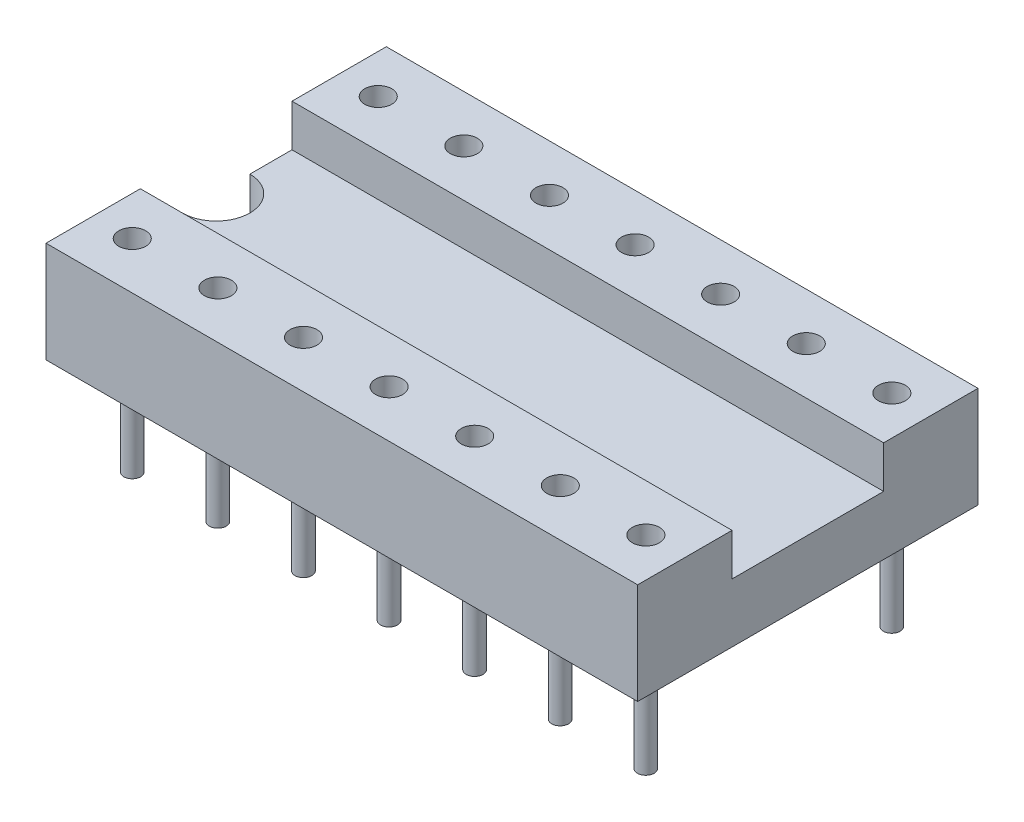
ISO-10303-21;
HEADER;
FILE_DESCRIPTION(('STEP AP214'),'2;1');
FILE_NAME('part.step','',(''),(''),'','','');
FILE_SCHEMA(('AUTOMOTIVE_DESIGN { 1 0 10303 214 1 1 1 1 }'));
ENDSEC;
DATA;
#1=APPLICATION_CONTEXT('core data for automotive mechanical design processes');
#2=APPLICATION_PROTOCOL_DEFINITION('international standard','automotive_design',2000,#1);
#3=PRODUCT_CONTEXT('',#1,'mechanical');
#4=PRODUCT('Part','Part','',(#3));
#5=PRODUCT_RELATED_PRODUCT_CATEGORY('part','',(#4));
#6=PRODUCT_DEFINITION_FORMATION('','',#4);
#7=PRODUCT_DEFINITION_CONTEXT('part definition',#1,'design');
#8=PRODUCT_DEFINITION('design','',#6,#7);
#9=PRODUCT_DEFINITION_SHAPE('','',#8);
#10=(LENGTH_UNIT() NAMED_UNIT(*) SI_UNIT(.MILLI.,.METRE.));
#11=(NAMED_UNIT(*) PLANE_ANGLE_UNIT() SI_UNIT($,.RADIAN.));
#12=(NAMED_UNIT(*) SI_UNIT($,.STERADIAN.) SOLID_ANGLE_UNIT());
#13=UNCERTAINTY_MEASURE_WITH_UNIT(LENGTH_MEASURE(1.E-05),#10,'distance_accuracy_value','');
#14=(GEOMETRIC_REPRESENTATION_CONTEXT(3) GLOBAL_UNCERTAINTY_ASSIGNED_CONTEXT((#13)) GLOBAL_UNIT_ASSIGNED_CONTEXT((#10,
#11,#12)) REPRESENTATION_CONTEXT('',''));
#15=CARTESIAN_POINT('',(0.,0.,0.));
#16=DIRECTION('',(0.,0.,1.));
#17=DIRECTION('',(1.,0.,0.));
#18=AXIS2_PLACEMENT_3D('',#15,#16,#17);
#19=CARTESIAN_POINT('',(17.56,0.,5.05));
#20=DIRECTION('',(0.,1.,0.));
#21=DIRECTION('',(0.,0.,1.));
#22=AXIS2_PLACEMENT_3D('',#19,#20,#21);
#23=PLANE('',#22);
#24=CARTESIAN_POINT('',(16.4,0.,3.65));
#25=DIRECTION('',(0.,1.,0.));
#26=DIRECTION('',(0.,0.,1.));
#27=AXIS2_PLACEMENT_3D('',#24,#25,#26);
#28=CIRCLE('',#27,0.25);
#29=CARTESIAN_POINT('',(16.4,0.,3.9));
#30=VERTEX_POINT('',#29);
#31=EDGE_CURVE('E42',#30,#30,#28,.F.);
#32=ORIENTED_EDGE('',*,*,#31,.F.);
#33=EDGE_LOOP('',(#32));
#34=FACE_BOUND('',#33,.T.);
#35=CARTESIAN_POINT('',(13.86,0.,3.65));
#36=DIRECTION('',(0.,1.,0.));
#37=DIRECTION('',(0.,0.,1.));
#38=AXIS2_PLACEMENT_3D('',#35,#36,#37);
#39=CIRCLE('',#38,0.25);
#40=CARTESIAN_POINT('',(13.86,0.,3.9));
#41=VERTEX_POINT('',#40);
#42=EDGE_CURVE('E218',#41,#41,#39,.F.);
#43=ORIENTED_EDGE('',*,*,#42,.F.);
#44=EDGE_LOOP('',(#43));
#45=FACE_BOUND('',#44,.T.);
#46=CARTESIAN_POINT('',(11.32,0.,3.65));
#47=DIRECTION('',(0.,1.,0.));
#48=DIRECTION('',(0.,0.,1.));
#49=AXIS2_PLACEMENT_3D('',#46,#47,#48);
#50=CIRCLE('',#49,0.25);
#51=CARTESIAN_POINT('',(11.32,0.,3.9));
#52=VERTEX_POINT('',#51);
#53=EDGE_CURVE('E212',#52,#52,#50,.F.);
#54=ORIENTED_EDGE('',*,*,#53,.F.);
#55=EDGE_LOOP('',(#54));
#56=FACE_BOUND('',#55,.T.);
#57=CARTESIAN_POINT('',(8.78,0.,3.65));
#58=DIRECTION('',(0.,1.,0.));
#59=DIRECTION('',(0.,0.,1.));
#60=AXIS2_PLACEMENT_3D('',#57,#58,#59);
#61=CIRCLE('',#60,0.25);
#62=CARTESIAN_POINT('',(8.78,0.,3.9));
#63=VERTEX_POINT('',#62);
#64=EDGE_CURVE('E206',#63,#63,#61,.F.);
#65=ORIENTED_EDGE('',*,*,#64,.F.);
#66=EDGE_LOOP('',(#65));
#67=FACE_BOUND('',#66,.T.);
#68=CARTESIAN_POINT('',(6.24,0.,3.65));
#69=DIRECTION('',(0.,1.,0.));
#70=DIRECTION('',(0.,0.,1.));
#71=AXIS2_PLACEMENT_3D('',#68,#69,#70);
#72=CIRCLE('',#71,0.25);
#73=CARTESIAN_POINT('',(6.24,0.,3.9));
#74=VERTEX_POINT('',#73);
#75=EDGE_CURVE('E200',#74,#74,#72,.F.);
#76=ORIENTED_EDGE('',*,*,#75,.F.);
#77=EDGE_LOOP('',(#76));
#78=FACE_BOUND('',#77,.T.);
#79=CARTESIAN_POINT('',(3.7,0.,3.65));
#80=DIRECTION('',(0.,1.,0.));
#81=DIRECTION('',(0.,0.,1.));
#82=AXIS2_PLACEMENT_3D('',#79,#80,#81);
#83=CIRCLE('',#82,0.25);
#84=CARTESIAN_POINT('',(3.7,0.,3.9));
#85=VERTEX_POINT('',#84);
#86=EDGE_CURVE('E194',#85,#85,#83,.F.);
#87=ORIENTED_EDGE('',*,*,#86,.F.);
#88=EDGE_LOOP('',(#87));
#89=FACE_BOUND('',#88,.T.);
#90=CARTESIAN_POINT('',(1.16,0.,3.65));
#91=DIRECTION('',(0.,1.,0.));
#92=DIRECTION('',(0.,0.,1.));
#93=AXIS2_PLACEMENT_3D('',#90,#91,#92);
#94=CIRCLE('',#93,0.25);
#95=CARTESIAN_POINT('',(1.16,0.,3.9));
#96=VERTEX_POINT('',#95);
#97=EDGE_CURVE('E188',#96,#96,#94,.F.);
#98=ORIENTED_EDGE('',*,*,#97,.F.);
#99=EDGE_LOOP('',(#98));
#100=FACE_BOUND('',#99,.T.);
#101=DIRECTION('',(0.,0.,-1.));
#102=VECTOR('',#101,1.);
#103=CARTESIAN_POINT('',(0.,0.,5.05));
#104=LINE('',#103,#102);
#105=CARTESIAN_POINT('',(0.,0.,5.05));
#106=VERTEX_POINT('',#105);
#107=CARTESIAN_POINT('',(0.,0.,1.));
#108=VERTEX_POINT('',#107);
#109=EDGE_CURVE('E142',#106,#108,#104,.T.);
#110=ORIENTED_EDGE('',*,*,#109,.T.);
#111=CARTESIAN_POINT('',(0.,0.,0.));
#112=DIRECTION('',(0.,1.,0.));
#113=DIRECTION('',(0.,0.,1.));
#114=AXIS2_PLACEMENT_3D('',#111,#112,#113);
#115=CIRCLE('',#114,1.);
#116=CARTESIAN_POINT('',(0.,0.,-1.));
#117=VERTEX_POINT('',#116);
#118=EDGE_CURVE('E49',#108,#117,#115,.T.);
#119=ORIENTED_EDGE('',*,*,#118,.T.);
#120=CARTESIAN_POINT('',(0.,0.,-5.05));
#121=VERTEX_POINT('',#120);
#122=EDGE_CURVE('E127',#117,#121,#104,.T.);
#123=ORIENTED_EDGE('',*,*,#122,.T.);
#124=DIRECTION('',(-1.,0.,0.));
#125=VECTOR('',#124,1.);
#126=CARTESIAN_POINT('',(17.56,0.,-5.05));
#127=LINE('',#126,#125);
#128=CARTESIAN_POINT('',(17.56,0.,-5.05));
#129=VERTEX_POINT('',#128);
#130=EDGE_CURVE('E173',#129,#121,#127,.T.);
#131=ORIENTED_EDGE('',*,*,#130,.F.);
#132=DIRECTION('',(0.,0.,-1.));
#133=VECTOR('',#132,1.);
#134=CARTESIAN_POINT('',(17.56,0.,5.05));
#135=LINE('',#134,#133);
#136=CARTESIAN_POINT('',(17.56,0.,5.05));
#137=VERTEX_POINT('',#136);
#138=EDGE_CURVE('E159',#137,#129,#135,.T.);
#139=ORIENTED_EDGE('',*,*,#138,.F.);
#140=DIRECTION('',(-1.,0.,0.));
#141=VECTOR('',#140,1.);
#142=CARTESIAN_POINT('',(17.56,0.,5.05));
#143=LINE('',#142,#141);
#144=EDGE_CURVE('E176',#137,#106,#143,.T.);
#145=ORIENTED_EDGE('',*,*,#144,.T.);
#146=EDGE_LOOP('',(#110,#119,#123,#131,#139,#145));
#147=FACE_BOUND('',#146,.T.);
#148=CARTESIAN_POINT('',(1.16,0.,-3.65));
#149=DIRECTION('',(0.,1.,0.));
#150=DIRECTION('',(0.,0.,1.));
#151=AXIS2_PLACEMENT_3D('',#148,#149,#150);
#152=CIRCLE('',#151,0.25);
#153=CARTESIAN_POINT('',(1.16,0.,-3.4));
#154=VERTEX_POINT('',#153);
#155=EDGE_CURVE('E191',#154,#154,#152,.F.);
#156=ORIENTED_EDGE('',*,*,#155,.F.);
#157=EDGE_LOOP('',(#156));
#158=FACE_BOUND('',#157,.T.);
#159=CARTESIAN_POINT('',(3.7,0.,-3.65));
#160=DIRECTION('',(0.,1.,0.));
#161=DIRECTION('',(0.,0.,1.));
#162=AXIS2_PLACEMENT_3D('',#159,#160,#161);
#163=CIRCLE('',#162,0.25);
#164=CARTESIAN_POINT('',(3.7,0.,-3.4));
#165=VERTEX_POINT('',#164);
#166=EDGE_CURVE('E197',#165,#165,#163,.F.);
#167=ORIENTED_EDGE('',*,*,#166,.F.);
#168=EDGE_LOOP('',(#167));
#169=FACE_BOUND('',#168,.T.);
#170=CARTESIAN_POINT('',(6.24,0.,-3.65));
#171=DIRECTION('',(0.,1.,0.));
#172=DIRECTION('',(0.,0.,1.));
#173=AXIS2_PLACEMENT_3D('',#170,#171,#172);
#174=CIRCLE('',#173,0.25);
#175=CARTESIAN_POINT('',(6.24,0.,-3.4));
#176=VERTEX_POINT('',#175);
#177=EDGE_CURVE('E203',#176,#176,#174,.F.);
#178=ORIENTED_EDGE('',*,*,#177,.F.);
#179=EDGE_LOOP('',(#178));
#180=FACE_BOUND('',#179,.T.);
#181=CARTESIAN_POINT('',(8.78,0.,-3.65));
#182=DIRECTION('',(0.,1.,0.));
#183=DIRECTION('',(0.,0.,1.));
#184=AXIS2_PLACEMENT_3D('',#181,#182,#183);
#185=CIRCLE('',#184,0.25);
#186=CARTESIAN_POINT('',(8.78,0.,-3.4));
#187=VERTEX_POINT('',#186);
#188=EDGE_CURVE('E209',#187,#187,#185,.F.);
#189=ORIENTED_EDGE('',*,*,#188,.F.);
#190=EDGE_LOOP('',(#189));
#191=FACE_BOUND('',#190,.T.);
#192=CARTESIAN_POINT('',(11.32,0.,-3.65));
#193=DIRECTION('',(0.,1.,0.));
#194=DIRECTION('',(0.,0.,1.));
#195=AXIS2_PLACEMENT_3D('',#192,#193,#194);
#196=CIRCLE('',#195,0.25);
#197=CARTESIAN_POINT('',(11.32,0.,-3.4));
#198=VERTEX_POINT('',#197);
#199=EDGE_CURVE('E215',#198,#198,#196,.F.);
#200=ORIENTED_EDGE('',*,*,#199,.F.);
#201=EDGE_LOOP('',(#200));
#202=FACE_BOUND('',#201,.T.);
#203=CARTESIAN_POINT('',(13.86,0.,-3.65));
#204=DIRECTION('',(0.,1.,0.));
#205=DIRECTION('',(0.,0.,1.));
#206=AXIS2_PLACEMENT_3D('',#203,#204,#205);
#207=CIRCLE('',#206,0.25);
#208=CARTESIAN_POINT('',(13.86,0.,-3.4));
#209=VERTEX_POINT('',#208);
#210=EDGE_CURVE('E221',#209,#209,#207,.F.);
#211=ORIENTED_EDGE('',*,*,#210,.F.);
#212=EDGE_LOOP('',(#211));
#213=FACE_BOUND('',#212,.T.);
#214=CARTESIAN_POINT('',(16.4,0.,-3.65));
#215=DIRECTION('',(0.,1.,0.));
#216=DIRECTION('',(0.,0.,1.));
#217=AXIS2_PLACEMENT_3D('',#214,#215,#216);
#218=CIRCLE('',#217,0.25);
#219=CARTESIAN_POINT('',(16.4,0.,-3.4));
#220=VERTEX_POINT('',#219);
#221=EDGE_CURVE('E11',#220,#220,#218,.F.);
#222=ORIENTED_EDGE('',*,*,#221,.F.);
#223=EDGE_LOOP('',(#222));
#224=FACE_BOUND('',#223,.T.);
#225=ADVANCED_FACE('F34',(#34,#45,#56,#67,#78,#89,#100,#147,#158,#169,#180,#191,#202,#213,#224),
#23,.F.);
#226=CARTESIAN_POINT('',(0.,1.75,5.05));
#227=DIRECTION('',(1.,0.,0.));
#228=DIRECTION('',(0.,0.,-1.));
#229=AXIS2_PLACEMENT_3D('',#226,#227,#228);
#230=PLANE('',#229);
#231=ORIENTED_EDGE('',*,*,#122,.F.);
#232=DIRECTION('',(0.,1.,0.));
#233=VECTOR('',#232,1.);
#234=CARTESIAN_POINT('',(0.,0.,-1.));
#235=LINE('',#234,#233);
#236=CARTESIAN_POINT('',(0.,1.75,-1.));
#237=VERTEX_POINT('',#236);
#238=EDGE_CURVE('E113',#117,#237,#235,.T.);
#239=ORIENTED_EDGE('',*,*,#238,.T.);
#240=DIRECTION('',(0.,0.,1.));
#241=VECTOR('',#240,1.);
#242=CARTESIAN_POINT('',(0.,1.75,-2.25));
#243=LINE('',#242,#241);
#244=CARTESIAN_POINT('',(0.,1.75,-2.25));
#245=VERTEX_POINT('',#244);
#246=EDGE_CURVE('E125',#245,#237,#243,.T.);
#247=ORIENTED_EDGE('',*,*,#246,.F.);
#248=DIRECTION('',(0.,-1.,0.));
#249=VECTOR('',#248,1.);
#250=CARTESIAN_POINT('',(0.,3.,-2.25));
#251=LINE('',#250,#249);
#252=CARTESIAN_POINT('',(0.,3.,-2.25));
#253=VERTEX_POINT('',#252);
#254=EDGE_CURVE('E149',#253,#245,#251,.T.);
#255=ORIENTED_EDGE('',*,*,#254,.F.);
#256=DIRECTION('',(0.,0.,1.));
#257=VECTOR('',#256,1.);
#258=CARTESIAN_POINT('',(0.,3.,-5.05));
#259=LINE('',#258,#257);
#260=CARTESIAN_POINT('',(0.,3.,-5.05));
#261=VERTEX_POINT('',#260);
#262=EDGE_CURVE('E147',#261,#253,#259,.T.);
#263=ORIENTED_EDGE('',*,*,#262,.F.);
#264=DIRECTION('',(0.,1.,0.));
#265=VECTOR('',#264,1.);
#266=CARTESIAN_POINT('',(0.,0.,-5.05));
#267=LINE('',#266,#265);
#268=EDGE_CURVE('E145',#121,#261,#267,.T.);
#269=ORIENTED_EDGE('',*,*,#268,.F.);
#270=EDGE_LOOP('',(#231,#239,#247,#255,#263,#269));
#271=FACE_BOUND('',#270,.T.);
#272=ADVANCED_FACE('F123',(#271),#230,.F.);
#273=CARTESIAN_POINT('',(17.56,1.75,-2.25));
#274=DIRECTION('',(0.,-1.,0.));
#275=DIRECTION('',(0.,0.,-1.));
#276=AXIS2_PLACEMENT_3D('',#273,#274,#275);
#277=PLANE('',#276);
#278=ORIENTED_EDGE('',*,*,#246,.T.);
#279=CARTESIAN_POINT('',(0.,1.75,0.));
#280=DIRECTION('',(0.,1.,0.));
#281=DIRECTION('',(0.,0.,1.));
#282=AXIS2_PLACEMENT_3D('',#279,#280,#281);
#283=CIRCLE('',#282,1.);
#284=CARTESIAN_POINT('',(0.,1.75,1.));
#285=VERTEX_POINT('',#284);
#286=EDGE_CURVE('E110',#285,#237,#283,.T.);
#287=ORIENTED_EDGE('',*,*,#286,.F.);
#288=CARTESIAN_POINT('',(0.,1.75,2.25));
#289=VERTEX_POINT('',#288);
#290=EDGE_CURVE('E133',#285,#289,#243,.T.);
#291=ORIENTED_EDGE('',*,*,#290,.T.);
#292=DIRECTION('',(-1.,0.,0.));
#293=VECTOR('',#292,1.);
#294=CARTESIAN_POINT('',(17.56,1.75,2.25));
#295=LINE('',#294,#293);
#296=CARTESIAN_POINT('',(17.56,1.75,2.25));
#297=VERTEX_POINT('',#296);
#298=EDGE_CURVE('E185',#297,#289,#295,.T.);
#299=ORIENTED_EDGE('',*,*,#298,.F.);
#300=DIRECTION('',(0.,0.,1.));
#301=VECTOR('',#300,1.);
#302=CARTESIAN_POINT('',(17.56,1.75,-2.25));
#303=LINE('',#302,#301);
#304=CARTESIAN_POINT('',(17.56,1.75,-2.25));
#305=VERTEX_POINT('',#304);
#306=EDGE_CURVE('E151',#305,#297,#303,.T.);
#307=ORIENTED_EDGE('',*,*,#306,.F.);
#308=DIRECTION('',(-1.,0.,0.));
#309=VECTOR('',#308,1.);
#310=CARTESIAN_POINT('',(17.56,1.75,-2.25));
#311=LINE('',#310,#309);
#312=EDGE_CURVE('E131',#305,#245,#311,.T.);
#313=ORIENTED_EDGE('',*,*,#312,.T.);
#314=EDGE_LOOP('',(#278,#287,#291,#299,#307,#313));
#315=FACE_BOUND('',#314,.T.);
#316=ADVANCED_FACE('F36',(#315),#277,.F.);
#317=CARTESIAN_POINT('',(17.56,1.75,2.25));
#318=DIRECTION('',(0.,0.,1.));
#319=DIRECTION('',(0.,-1.,0.));
#320=AXIS2_PLACEMENT_3D('',#317,#318,#319);
#321=PLANE('',#320);
#322=DIRECTION('',(0.,1.,0.));
#323=VECTOR('',#322,1.);
#324=CARTESIAN_POINT('',(0.,1.75,2.25));
#325=LINE('',#324,#323);
#326=CARTESIAN_POINT('',(0.,3.,2.25));
#327=VERTEX_POINT('',#326);
#328=EDGE_CURVE('E132',#289,#327,#325,.T.);
#329=ORIENTED_EDGE('',*,*,#328,.T.);
#330=DIRECTION('',(-1.,0.,0.));
#331=VECTOR('',#330,1.);
#332=CARTESIAN_POINT('',(17.56,3.,2.25));
#333=LINE('',#332,#331);
#334=CARTESIAN_POINT('',(17.56,3.,2.25));
#335=VERTEX_POINT('',#334);
#336=EDGE_CURVE('E182',#335,#327,#333,.T.);
#337=ORIENTED_EDGE('',*,*,#336,.F.);
#338=DIRECTION('',(0.,1.,0.));
#339=VECTOR('',#338,1.);
#340=CARTESIAN_POINT('',(17.56,1.75,2.25));
#341=LINE('',#340,#339);
#342=EDGE_CURVE('E153',#297,#335,#341,.T.);
#343=ORIENTED_EDGE('',*,*,#342,.F.);
#344=ORIENTED_EDGE('',*,*,#298,.T.);
#345=EDGE_LOOP('',(#329,#337,#343,#344));
#346=FACE_BOUND('',#345,.T.);
#347=ADVANCED_FACE('F513',(#346),#321,.F.);
#348=CARTESIAN_POINT('',(17.56,3.,2.25));
#349=DIRECTION('',(0.,-1.,0.));
#350=DIRECTION('',(0.,0.,-1.));
#351=AXIS2_PLACEMENT_3D('',#348,#349,#350);
#352=PLANE('',#351);
#353=CARTESIAN_POINT('',(16.403,3.,3.64999999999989));
#354=DIRECTION('',(0.,1.,0.));
#355=DIRECTION('',(0.,0.,1.));
#356=AXIS2_PLACEMENT_3D('',#353,#354,#355);
#357=CIRCLE('',#356,0.400000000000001);
#358=CARTESIAN_POINT('',(16.403,3.,4.04999999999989));
#359=VERTEX_POINT('',#358);
#360=EDGE_CURVE('E610',#359,#359,#357,.T.);
#361=ORIENTED_EDGE('',*,*,#360,.F.);
#362=EDGE_LOOP('',(#361));
#363=FACE_BOUND('',#362,.T.);
#364=CARTESIAN_POINT('',(13.863,3.,3.64999999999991));
#365=DIRECTION('',(0.,1.,0.));
#366=DIRECTION('',(0.,0.,1.));
#367=AXIS2_PLACEMENT_3D('',#364,#365,#366);
#368=CIRCLE('',#367,0.400000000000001);
#369=CARTESIAN_POINT('',(13.863,3.,4.04999999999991));
#370=VERTEX_POINT('',#369);
#371=EDGE_CURVE('E598',#370,#370,#368,.T.);
#372=ORIENTED_EDGE('',*,*,#371,.F.);
#373=EDGE_LOOP('',(#372));
#374=FACE_BOUND('',#373,.T.);
#375=CARTESIAN_POINT('',(11.323,3.,3.64999999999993));
#376=DIRECTION('',(0.,1.,0.));
#377=DIRECTION('',(0.,0.,1.));
#378=AXIS2_PLACEMENT_3D('',#375,#376,#377);
#379=CIRCLE('',#378,0.399999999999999);
#380=CARTESIAN_POINT('',(11.323,3.,4.04999999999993));
#381=VERTEX_POINT('',#380);
#382=EDGE_CURVE('E586',#381,#381,#379,.T.);
#383=ORIENTED_EDGE('',*,*,#382,.F.);
#384=EDGE_LOOP('',(#383));
#385=FACE_BOUND('',#384,.T.);
#386=CARTESIAN_POINT('',(8.783,3.,3.64999999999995));
#387=DIRECTION('',(0.,1.,0.));
#388=DIRECTION('',(0.,0.,1.));
#389=AXIS2_PLACEMENT_3D('',#386,#387,#388);
#390=CIRCLE('',#389,0.399999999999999);
#391=CARTESIAN_POINT('',(8.783,3.,4.04999999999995));
#392=VERTEX_POINT('',#391);
#393=EDGE_CURVE('E574',#392,#392,#390,.T.);
#394=ORIENTED_EDGE('',*,*,#393,.F.);
#395=EDGE_LOOP('',(#394));
#396=FACE_BOUND('',#395,.T.);
#397=CARTESIAN_POINT('',(6.242,3.,3.64999999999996));
#398=DIRECTION('',(0.,1.,0.));
#399=DIRECTION('',(0.,0.,1.));
#400=AXIS2_PLACEMENT_3D('',#397,#398,#399);
#401=CIRCLE('',#400,0.4);
#402=CARTESIAN_POINT('',(6.242,3.,4.04999999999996));
#403=VERTEX_POINT('',#402);
#404=EDGE_CURVE('E562',#403,#403,#401,.T.);
#405=ORIENTED_EDGE('',*,*,#404,.F.);
#406=EDGE_LOOP('',(#405));
#407=FACE_BOUND('',#406,.T.);
#408=CARTESIAN_POINT('',(3.701,3.,3.64999999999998));
#409=DIRECTION('',(0.,1.,0.));
#410=DIRECTION('',(0.,0.,1.));
#411=AXIS2_PLACEMENT_3D('',#408,#409,#410);
#412=CIRCLE('',#411,0.4);
#413=CARTESIAN_POINT('',(3.701,3.,4.04999999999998));
#414=VERTEX_POINT('',#413);
#415=EDGE_CURVE('E550',#414,#414,#412,.T.);
#416=ORIENTED_EDGE('',*,*,#415,.F.);
#417=EDGE_LOOP('',(#416));
#418=FACE_BOUND('',#417,.T.);
#419=CARTESIAN_POINT('',(1.16,3.,3.65));
#420=DIRECTION('',(0.,1.,0.));
#421=DIRECTION('',(0.,0.,1.));
#422=AXIS2_PLACEMENT_3D('',#419,#420,#421);
#423=CIRCLE('',#422,0.4);
#424=CARTESIAN_POINT('',(1.16,3.,4.05));
#425=VERTEX_POINT('',#424);
#426=EDGE_CURVE('E538',#425,#425,#423,.T.);
#427=ORIENTED_EDGE('',*,*,#426,.F.);
#428=EDGE_LOOP('',(#427));
#429=FACE_BOUND('',#428,.T.);
#430=DIRECTION('',(0.,0.,1.));
#431=VECTOR('',#430,1.);
#432=CARTESIAN_POINT('',(0.,3.,2.25));
#433=LINE('',#432,#431);
#434=CARTESIAN_POINT('',(0.,3.,5.05));
#435=VERTEX_POINT('',#434);
#436=EDGE_CURVE('E135',#327,#435,#433,.T.);
#437=ORIENTED_EDGE('',*,*,#436,.T.);
#438=DIRECTION('',(-1.,0.,0.));
#439=VECTOR('',#438,1.);
#440=CARTESIAN_POINT('',(17.56,3.,5.05));
#441=LINE('',#440,#439);
#442=CARTESIAN_POINT('',(17.56,3.,5.05));
#443=VERTEX_POINT('',#442);
#444=EDGE_CURVE('E179',#443,#435,#441,.T.);
#445=ORIENTED_EDGE('',*,*,#444,.F.);
#446=DIRECTION('',(0.,0.,1.));
#447=VECTOR('',#446,1.);
#448=CARTESIAN_POINT('',(17.56,3.,2.25));
#449=LINE('',#448,#447);
#450=EDGE_CURVE('E155',#335,#443,#449,.T.);
#451=ORIENTED_EDGE('',*,*,#450,.F.);
#452=ORIENTED_EDGE('',*,*,#336,.T.);
#453=EDGE_LOOP('',(#437,#445,#451,#452));
#454=FACE_BOUND('',#453,.T.);
#455=ADVANCED_FACE('F510',(#363,#374,#385,#396,#407,#418,#429,#454),#352,.F.);
#456=CARTESIAN_POINT('',(17.56,3.,5.05));
#457=DIRECTION('',(0.,0.,-1.));
#458=DIRECTION('',(-1.,0.,0.));
#459=AXIS2_PLACEMENT_3D('',#456,#457,#458);
#460=PLANE('',#459);
#461=DIRECTION('',(0.,-1.,0.));
#462=VECTOR('',#461,1.);
#463=CARTESIAN_POINT('',(0.,3.,5.05));
#464=LINE('',#463,#462);
#465=EDGE_CURVE('E140',#435,#106,#464,.T.);
#466=ORIENTED_EDGE('',*,*,#465,.T.);
#467=ORIENTED_EDGE('',*,*,#144,.F.);
#468=DIRECTION('',(0.,-1.,0.));
#469=VECTOR('',#468,1.);
#470=CARTESIAN_POINT('',(17.56,3.,5.05));
#471=LINE('',#470,#469);
#472=EDGE_CURVE('E157',#443,#137,#471,.T.);
#473=ORIENTED_EDGE('',*,*,#472,.F.);
#474=ORIENTED_EDGE('',*,*,#444,.T.);
#475=EDGE_LOOP('',(#466,#467,#473,#474));
#476=FACE_BOUND('',#475,.T.);
#477=ADVANCED_FACE('F505',(#476),#460,.F.);
#478=CARTESIAN_POINT('',(17.56,0.,-5.05));
#479=DIRECTION('',(0.,0.,1.));
#480=DIRECTION('',(0.,-1.,0.));
#481=AXIS2_PLACEMENT_3D('',#478,#479,#480);
#482=PLANE('',#481);
#483=ORIENTED_EDGE('',*,*,#268,.T.);
#484=DIRECTION('',(-1.,0.,0.));
#485=VECTOR('',#484,1.);
#486=CARTESIAN_POINT('',(17.56,3.,-5.05));
#487=LINE('',#486,#485);
#488=CARTESIAN_POINT('',(17.56,3.,-5.05));
#489=VERTEX_POINT('',#488);
#490=EDGE_CURVE('E170',#489,#261,#487,.T.);
#491=ORIENTED_EDGE('',*,*,#490,.F.);
#492=DIRECTION('',(0.,1.,0.));
#493=VECTOR('',#492,1.);
#494=CARTESIAN_POINT('',(17.56,0.,-5.05));
#495=LINE('',#494,#493);
#496=EDGE_CURVE('E161',#129,#489,#495,.T.);
#497=ORIENTED_EDGE('',*,*,#496,.F.);
#498=ORIENTED_EDGE('',*,*,#130,.T.);
#499=EDGE_LOOP('',(#483,#491,#497,#498));
#500=FACE_BOUND('',#499,.T.);
#501=ADVANCED_FACE('F502',(#500),#482,.F.);
#502=CARTESIAN_POINT('',(17.56,3.,-5.05));
#503=DIRECTION('',(0.,-1.,0.));
#504=DIRECTION('',(0.,0.,-1.));
#505=AXIS2_PLACEMENT_3D('',#502,#503,#504);
#506=PLANE('',#505);
#507=CARTESIAN_POINT('',(16.403,3.,-3.65000000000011));
#508=DIRECTION('',(0.,1.,0.));
#509=DIRECTION('',(0.,0.,-1.));
#510=AXIS2_PLACEMENT_3D('',#507,#508,#509);
#511=CIRCLE('',#510,0.400000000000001);
#512=CARTESIAN_POINT('',(16.403,3.,-4.05000000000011));
#513=VERTEX_POINT('',#512);
#514=EDGE_CURVE('E616',#513,#513,#511,.T.);
#515=ORIENTED_EDGE('',*,*,#514,.F.);
#516=EDGE_LOOP('',(#515));
#517=FACE_BOUND('',#516,.T.);
#518=CARTESIAN_POINT('',(13.863,3.,-3.65000000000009));
#519=DIRECTION('',(0.,1.,0.));
#520=DIRECTION('',(0.,0.,-1.));
#521=AXIS2_PLACEMENT_3D('',#518,#519,#520);
#522=CIRCLE('',#521,0.400000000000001);
#523=CARTESIAN_POINT('',(13.863,3.,-4.05000000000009));
#524=VERTEX_POINT('',#523);
#525=EDGE_CURVE('E604',#524,#524,#522,.T.);
#526=ORIENTED_EDGE('',*,*,#525,.F.);
#527=EDGE_LOOP('',(#526));
#528=FACE_BOUND('',#527,.T.);
#529=CARTESIAN_POINT('',(11.323,3.,-3.65000000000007));
#530=DIRECTION('',(0.,1.,0.));
#531=DIRECTION('',(0.,0.,-1.));
#532=AXIS2_PLACEMENT_3D('',#529,#530,#531);
#533=CIRCLE('',#532,0.399999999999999);
#534=CARTESIAN_POINT('',(11.323,3.,-4.05000000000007));
#535=VERTEX_POINT('',#534);
#536=EDGE_CURVE('E592',#535,#535,#533,.T.);
#537=ORIENTED_EDGE('',*,*,#536,.F.);
#538=EDGE_LOOP('',(#537));
#539=FACE_BOUND('',#538,.T.);
#540=CARTESIAN_POINT('',(8.783,3.,-3.65000000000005));
#541=DIRECTION('',(0.,1.,0.));
#542=DIRECTION('',(0.,0.,-1.));
#543=AXIS2_PLACEMENT_3D('',#540,#541,#542);
#544=CIRCLE('',#543,0.399999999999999);
#545=CARTESIAN_POINT('',(8.783,3.,-4.05000000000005));
#546=VERTEX_POINT('',#545);
#547=EDGE_CURVE('E580',#546,#546,#544,.T.);
#548=ORIENTED_EDGE('',*,*,#547,.F.);
#549=EDGE_LOOP('',(#548));
#550=FACE_BOUND('',#549,.T.);
#551=CARTESIAN_POINT('',(6.242,3.,-3.65000000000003));
#552=DIRECTION('',(0.,1.,0.));
#553=DIRECTION('',(0.,0.,-1.));
#554=AXIS2_PLACEMENT_3D('',#551,#552,#553);
#555=CIRCLE('',#554,0.4);
#556=CARTESIAN_POINT('',(6.242,3.,-4.05000000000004));
#557=VERTEX_POINT('',#556);
#558=EDGE_CURVE('E568',#557,#557,#555,.T.);
#559=ORIENTED_EDGE('',*,*,#558,.F.);
#560=EDGE_LOOP('',(#559));
#561=FACE_BOUND('',#560,.T.);
#562=CARTESIAN_POINT('',(3.701,3.,-3.65000000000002));
#563=DIRECTION('',(0.,1.,0.));
#564=DIRECTION('',(0.,0.,-1.));
#565=AXIS2_PLACEMENT_3D('',#562,#563,#564);
#566=CIRCLE('',#565,0.4);
#567=CARTESIAN_POINT('',(3.701,3.,-4.05000000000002));
#568=VERTEX_POINT('',#567);
#569=EDGE_CURVE('E556',#568,#568,#566,.T.);
#570=ORIENTED_EDGE('',*,*,#569,.F.);
#571=EDGE_LOOP('',(#570));
#572=FACE_BOUND('',#571,.T.);
#573=CARTESIAN_POINT('',(1.16,3.,-3.65));
#574=DIRECTION('',(0.,1.,0.));
#575=DIRECTION('',(0.,0.,-1.));
#576=AXIS2_PLACEMENT_3D('',#573,#574,#575);
#577=CIRCLE('',#576,0.4);
#578=CARTESIAN_POINT('',(1.16,3.,-4.05));
#579=VERTEX_POINT('',#578);
#580=EDGE_CURVE('E544',#579,#579,#577,.T.);
#581=ORIENTED_EDGE('',*,*,#580,.F.);
#582=EDGE_LOOP('',(#581));
#583=FACE_BOUND('',#582,.T.);
#584=ORIENTED_EDGE('',*,*,#262,.T.);
#585=DIRECTION('',(-1.,0.,0.));
#586=VECTOR('',#585,1.);
#587=CARTESIAN_POINT('',(17.56,3.,-2.25));
#588=LINE('',#587,#586);
#589=CARTESIAN_POINT('',(17.56,3.,-2.25));
#590=VERTEX_POINT('',#589);
#591=EDGE_CURVE('E167',#590,#253,#588,.T.);
#592=ORIENTED_EDGE('',*,*,#591,.F.);
#593=DIRECTION('',(0.,0.,1.));
#594=VECTOR('',#593,1.);
#595=CARTESIAN_POINT('',(17.56,3.,-5.05));
#596=LINE('',#595,#594);
#597=EDGE_CURVE('E163',#489,#590,#596,.T.);
#598=ORIENTED_EDGE('',*,*,#597,.F.);
#599=ORIENTED_EDGE('',*,*,#490,.T.);
#600=EDGE_LOOP('',(#584,#592,#598,#599));
#601=FACE_BOUND('',#600,.T.);
#602=ADVANCED_FACE('F498',(#517,#528,#539,#550,#561,#572,#583,#601),#506,.F.);
#603=CARTESIAN_POINT('',(17.56,3.,-2.25));
#604=DIRECTION('',(0.,0.,-1.));
#605=DIRECTION('',(0.,1.,0.));
#606=AXIS2_PLACEMENT_3D('',#603,#604,#605);
#607=PLANE('',#606);
#608=ORIENTED_EDGE('',*,*,#254,.T.);
#609=ORIENTED_EDGE('',*,*,#312,.F.);
#610=DIRECTION('',(0.,-1.,0.));
#611=VECTOR('',#610,1.);
#612=CARTESIAN_POINT('',(17.56,3.,-2.25));
#613=LINE('',#612,#611);
#614=EDGE_CURVE('E57',#590,#305,#613,.T.);
#615=ORIENTED_EDGE('',*,*,#614,.F.);
#616=ORIENTED_EDGE('',*,*,#591,.T.);
#617=EDGE_LOOP('',(#608,#609,#615,#616));
#618=FACE_BOUND('',#617,.T.);
#619=ADVANCED_FACE('F495',(#618),#607,.F.);
#620=CARTESIAN_POINT('',(17.56,1.75,5.05));
#621=DIRECTION('',(1.,0.,0.));
#622=DIRECTION('',(0.,0.,-1.));
#623=AXIS2_PLACEMENT_3D('',#620,#621,#622);
#624=PLANE('',#623);
#625=ORIENTED_EDGE('',*,*,#306,.T.);
#626=ORIENTED_EDGE('',*,*,#342,.T.);
#627=ORIENTED_EDGE('',*,*,#450,.T.);
#628=ORIENTED_EDGE('',*,*,#472,.T.);
#629=ORIENTED_EDGE('',*,*,#138,.T.);
#630=ORIENTED_EDGE('',*,*,#496,.T.);
#631=ORIENTED_EDGE('',*,*,#597,.T.);
#632=ORIENTED_EDGE('',*,*,#614,.T.);
#633=EDGE_LOOP('',(#625,#626,#627,#628,#629,#630,#631,#632));
#634=FACE_BOUND('',#633,.T.);
#635=ADVANCED_FACE('F491',(#634),#624,.T.);
#636=ORIENTED_EDGE('',*,*,#290,.F.);
#637=DIRECTION('',(0.,1.,0.));
#638=VECTOR('',#637,1.);
#639=CARTESIAN_POINT('',(0.,0.,1.));
#640=LINE('',#639,#638);
#641=EDGE_CURVE('E114',#108,#285,#640,.T.);
#642=ORIENTED_EDGE('',*,*,#641,.F.);
#643=ORIENTED_EDGE('',*,*,#109,.F.);
#644=ORIENTED_EDGE('',*,*,#465,.F.);
#645=ORIENTED_EDGE('',*,*,#436,.F.);
#646=ORIENTED_EDGE('',*,*,#328,.F.);
#647=EDGE_LOOP('',(#636,#642,#643,#644,#645,#646));
#648=FACE_BOUND('',#647,.T.);
#649=ADVANCED_FACE('F488',(#648),#230,.F.);
#650=CARTESIAN_POINT('',(0.,0.,0.));
#651=DIRECTION('',(0.,1.,0.));
#652=DIRECTION('',(0.,0.,1.));
#653=AXIS2_PLACEMENT_3D('',#650,#651,#652);
#654=CYLINDRICAL_SURFACE('',#653,1.);
#655=ORIENTED_EDGE('',*,*,#286,.T.);
#656=ORIENTED_EDGE('',*,*,#238,.F.);
#657=ORIENTED_EDGE('',*,*,#118,.F.);
#658=ORIENTED_EDGE('',*,*,#641,.T.);
#659=EDGE_LOOP('',(#655,#656,#657,#658));
#660=FACE_BOUND('',#659,.T.);
#661=ADVANCED_FACE('F112',(#660),#654,.F.);
#662=CARTESIAN_POINT('',(1.16,0.5,3.65));
#663=DIRECTION('',(0.,1.,0.));
#664=DIRECTION('',(0.,0.,1.));
#665=AXIS2_PLACEMENT_3D('',#662,#663,#664);
#666=CYLINDRICAL_SURFACE('',#665,0.4);
#667=CARTESIAN_POINT('',(1.16,0.5,3.65));
#668=DIRECTION('',(0.,1.,0.));
#669=DIRECTION('',(0.,0.,1.));
#670=AXIS2_PLACEMENT_3D('',#667,#668,#669);
#671=CIRCLE('',#670,0.4);
#672=CARTESIAN_POINT('',(1.16,0.5,4.05));
#673=VERTEX_POINT('',#672);
#674=EDGE_CURVE('E118',#673,#673,#671,.T.);
#675=ORIENTED_EDGE('',*,*,#674,.F.);
#676=EDGE_LOOP('',(#675));
#677=FACE_BOUND('',#676,.T.);
#678=ORIENTED_EDGE('',*,*,#426,.T.);
#679=EDGE_LOOP('',(#678));
#680=FACE_BOUND('',#679,.T.);
#681=ADVANCED_FACE('F481',(#677,#680),#666,.F.);
#682=CARTESIAN_POINT('',(1.16,0.5,3.65));
#683=DIRECTION('',(0.,1.,0.));
#684=DIRECTION('',(0.,0.,1.));
#685=AXIS2_PLACEMENT_3D('',#682,#683,#684);
#686=PLANE('',#685);
#687=ORIENTED_EDGE('',*,*,#674,.T.);
#688=EDGE_LOOP('',(#687));
#689=FACE_BOUND('',#688,.T.);
#690=ADVANCED_FACE('F477',(#689),#686,.T.);
#691=CARTESIAN_POINT('',(1.16,0.5,-3.65));
#692=DIRECTION('',(0.,1.,0.));
#693=DIRECTION('',(0.,0.,1.));
#694=AXIS2_PLACEMENT_3D('',#691,#692,#693);
#695=CYLINDRICAL_SURFACE('',#694,0.4);
#696=CARTESIAN_POINT('',(1.16,0.5,-3.65));
#697=DIRECTION('',(0.,1.,0.));
#698=DIRECTION('',(0.,0.,-1.));
#699=AXIS2_PLACEMENT_3D('',#696,#697,#698);
#700=CIRCLE('',#699,0.4);
#701=CARTESIAN_POINT('',(1.16,0.5,-4.05));
#702=VERTEX_POINT('',#701);
#703=EDGE_CURVE('E541',#702,#702,#700,.T.);
#704=ORIENTED_EDGE('',*,*,#703,.F.);
#705=EDGE_LOOP('',(#704));
#706=FACE_BOUND('',#705,.T.);
#707=ORIENTED_EDGE('',*,*,#580,.T.);
#708=EDGE_LOOP('',(#707));
#709=FACE_BOUND('',#708,.T.);
#710=ADVANCED_FACE('F473',(#706,#709),#695,.F.);
#711=CARTESIAN_POINT('',(1.16,0.5,-3.65));
#712=DIRECTION('',(0.,-1.,0.));
#713=DIRECTION('',(0.,0.,-1.));
#714=AXIS2_PLACEMENT_3D('',#711,#712,#713);
#715=PLANE('',#714);
#716=ORIENTED_EDGE('',*,*,#703,.T.);
#717=EDGE_LOOP('',(#716));
#718=FACE_BOUND('',#717,.T.);
#719=ADVANCED_FACE('F469',(#718),#715,.F.);
#720=CARTESIAN_POINT('',(3.701,0.5,3.64999999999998));
#721=DIRECTION('',(0.,1.,0.));
#722=DIRECTION('',(0.,0.,1.));
#723=AXIS2_PLACEMENT_3D('',#720,#721,#722);
#724=CYLINDRICAL_SURFACE('',#723,0.4);
#725=CARTESIAN_POINT('',(3.701,0.5,3.64999999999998));
#726=DIRECTION('',(0.,1.,0.));
#727=DIRECTION('',(0.,0.,1.));
#728=AXIS2_PLACEMENT_3D('',#725,#726,#727);
#729=CIRCLE('',#728,0.4);
#730=CARTESIAN_POINT('',(3.701,0.5,4.04999999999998));
#731=VERTEX_POINT('',#730);
#732=EDGE_CURVE('E547',#731,#731,#729,.T.);
#733=ORIENTED_EDGE('',*,*,#732,.F.);
#734=EDGE_LOOP('',(#733));
#735=FACE_BOUND('',#734,.T.);
#736=ORIENTED_EDGE('',*,*,#415,.T.);
#737=EDGE_LOOP('',(#736));
#738=FACE_BOUND('',#737,.T.);
#739=ADVANCED_FACE('F465',(#735,#738),#724,.F.);
#740=CARTESIAN_POINT('',(3.701,0.5,3.64999999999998));
#741=DIRECTION('',(0.,1.,0.));
#742=DIRECTION('',(0.,0.,1.));
#743=AXIS2_PLACEMENT_3D('',#740,#741,#742);
#744=PLANE('',#743);
#745=ORIENTED_EDGE('',*,*,#732,.T.);
#746=EDGE_LOOP('',(#745));
#747=FACE_BOUND('',#746,.T.);
#748=ADVANCED_FACE('F461',(#747),#744,.T.);
#749=CARTESIAN_POINT('',(3.701,0.5,-3.65000000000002));
#750=DIRECTION('',(0.,1.,0.));
#751=DIRECTION('',(0.,0.,1.));
#752=AXIS2_PLACEMENT_3D('',#749,#750,#751);
#753=CYLINDRICAL_SURFACE('',#752,0.4);
#754=CARTESIAN_POINT('',(3.701,0.5,-3.65000000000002));
#755=DIRECTION('',(0.,1.,0.));
#756=DIRECTION('',(0.,0.,-1.));
#757=AXIS2_PLACEMENT_3D('',#754,#755,#756);
#758=CIRCLE('',#757,0.4);
#759=CARTESIAN_POINT('',(3.701,0.5,-4.05000000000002));
#760=VERTEX_POINT('',#759);
#761=EDGE_CURVE('E553',#760,#760,#758,.T.);
#762=ORIENTED_EDGE('',*,*,#761,.F.);
#763=EDGE_LOOP('',(#762));
#764=FACE_BOUND('',#763,.T.);
#765=ORIENTED_EDGE('',*,*,#569,.T.);
#766=EDGE_LOOP('',(#765));
#767=FACE_BOUND('',#766,.T.);
#768=ADVANCED_FACE('F457',(#764,#767),#753,.F.);
#769=CARTESIAN_POINT('',(3.701,0.5,-3.65000000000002));
#770=DIRECTION('',(0.,-1.,0.));
#771=DIRECTION('',(0.,0.,-1.));
#772=AXIS2_PLACEMENT_3D('',#769,#770,#771);
#773=PLANE('',#772);
#774=ORIENTED_EDGE('',*,*,#761,.T.);
#775=EDGE_LOOP('',(#774));
#776=FACE_BOUND('',#775,.T.);
#777=ADVANCED_FACE('F453',(#776),#773,.F.);
#778=CARTESIAN_POINT('',(6.242,0.5,3.64999999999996));
#779=DIRECTION('',(0.,1.,0.));
#780=DIRECTION('',(0.,0.,1.));
#781=AXIS2_PLACEMENT_3D('',#778,#779,#780);
#782=CYLINDRICAL_SURFACE('',#781,0.4);
#783=CARTESIAN_POINT('',(6.242,0.5,3.64999999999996));
#784=DIRECTION('',(0.,1.,0.));
#785=DIRECTION('',(0.,0.,1.));
#786=AXIS2_PLACEMENT_3D('',#783,#784,#785);
#787=CIRCLE('',#786,0.4);
#788=CARTESIAN_POINT('',(6.242,0.5,4.04999999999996));
#789=VERTEX_POINT('',#788);
#790=EDGE_CURVE('E559',#789,#789,#787,.T.);
#791=ORIENTED_EDGE('',*,*,#790,.F.);
#792=EDGE_LOOP('',(#791));
#793=FACE_BOUND('',#792,.T.);
#794=ORIENTED_EDGE('',*,*,#404,.T.);
#795=EDGE_LOOP('',(#794));
#796=FACE_BOUND('',#795,.T.);
#797=ADVANCED_FACE('F449',(#793,#796),#782,.F.);
#798=CARTESIAN_POINT('',(6.242,0.5,3.64999999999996));
#799=DIRECTION('',(0.,1.,0.));
#800=DIRECTION('',(0.,0.,1.));
#801=AXIS2_PLACEMENT_3D('',#798,#799,#800);
#802=PLANE('',#801);
#803=ORIENTED_EDGE('',*,*,#790,.T.);
#804=EDGE_LOOP('',(#803));
#805=FACE_BOUND('',#804,.T.);
#806=ADVANCED_FACE('F445',(#805),#802,.T.);
#807=CARTESIAN_POINT('',(6.242,0.5,-3.65000000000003));
#808=DIRECTION('',(0.,1.,0.));
#809=DIRECTION('',(0.,0.,1.));
#810=AXIS2_PLACEMENT_3D('',#807,#808,#809);
#811=CYLINDRICAL_SURFACE('',#810,0.4);
#812=CARTESIAN_POINT('',(6.242,0.5,-3.65000000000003));
#813=DIRECTION('',(0.,1.,0.));
#814=DIRECTION('',(0.,0.,-1.));
#815=AXIS2_PLACEMENT_3D('',#812,#813,#814);
#816=CIRCLE('',#815,0.4);
#817=CARTESIAN_POINT('',(6.242,0.5,-4.05000000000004));
#818=VERTEX_POINT('',#817);
#819=EDGE_CURVE('E565',#818,#818,#816,.T.);
#820=ORIENTED_EDGE('',*,*,#819,.F.);
#821=EDGE_LOOP('',(#820));
#822=FACE_BOUND('',#821,.T.);
#823=ORIENTED_EDGE('',*,*,#558,.T.);
#824=EDGE_LOOP('',(#823));
#825=FACE_BOUND('',#824,.T.);
#826=ADVANCED_FACE('F441',(#822,#825),#811,.F.);
#827=CARTESIAN_POINT('',(6.242,0.5,-3.65000000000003));
#828=DIRECTION('',(0.,-1.,0.));
#829=DIRECTION('',(0.,0.,-1.));
#830=AXIS2_PLACEMENT_3D('',#827,#828,#829);
#831=PLANE('',#830);
#832=ORIENTED_EDGE('',*,*,#819,.T.);
#833=EDGE_LOOP('',(#832));
#834=FACE_BOUND('',#833,.T.);
#835=ADVANCED_FACE('F437',(#834),#831,.F.);
#836=CARTESIAN_POINT('',(8.783,0.5,3.64999999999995));
#837=DIRECTION('',(0.,1.,0.));
#838=DIRECTION('',(0.,0.,1.));
#839=AXIS2_PLACEMENT_3D('',#836,#837,#838);
#840=CYLINDRICAL_SURFACE('',#839,0.399999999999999);
#841=CARTESIAN_POINT('',(8.783,0.5,3.64999999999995));
#842=DIRECTION('',(0.,1.,0.));
#843=DIRECTION('',(0.,0.,1.));
#844=AXIS2_PLACEMENT_3D('',#841,#842,#843);
#845=CIRCLE('',#844,0.399999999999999);
#846=CARTESIAN_POINT('',(8.783,0.5,4.04999999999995));
#847=VERTEX_POINT('',#846);
#848=EDGE_CURVE('E571',#847,#847,#845,.T.);
#849=ORIENTED_EDGE('',*,*,#848,.F.);
#850=EDGE_LOOP('',(#849));
#851=FACE_BOUND('',#850,.T.);
#852=ORIENTED_EDGE('',*,*,#393,.T.);
#853=EDGE_LOOP('',(#852));
#854=FACE_BOUND('',#853,.T.);
#855=ADVANCED_FACE('F433',(#851,#854),#840,.F.);
#856=CARTESIAN_POINT('',(8.783,0.5,3.64999999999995));
#857=DIRECTION('',(0.,1.,0.));
#858=DIRECTION('',(0.,0.,1.));
#859=AXIS2_PLACEMENT_3D('',#856,#857,#858);
#860=PLANE('',#859);
#861=ORIENTED_EDGE('',*,*,#848,.T.);
#862=EDGE_LOOP('',(#861));
#863=FACE_BOUND('',#862,.T.);
#864=ADVANCED_FACE('F429',(#863),#860,.T.);
#865=CARTESIAN_POINT('',(8.783,0.5,-3.65000000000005));
#866=DIRECTION('',(0.,1.,0.));
#867=DIRECTION('',(0.,0.,1.));
#868=AXIS2_PLACEMENT_3D('',#865,#866,#867);
#869=CYLINDRICAL_SURFACE('',#868,0.399999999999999);
#870=CARTESIAN_POINT('',(8.783,0.5,-3.65000000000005));
#871=DIRECTION('',(0.,1.,0.));
#872=DIRECTION('',(0.,0.,-1.));
#873=AXIS2_PLACEMENT_3D('',#870,#871,#872);
#874=CIRCLE('',#873,0.399999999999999);
#875=CARTESIAN_POINT('',(8.783,0.5,-4.05000000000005));
#876=VERTEX_POINT('',#875);
#877=EDGE_CURVE('E577',#876,#876,#874,.T.);
#878=ORIENTED_EDGE('',*,*,#877,.F.);
#879=EDGE_LOOP('',(#878));
#880=FACE_BOUND('',#879,.T.);
#881=ORIENTED_EDGE('',*,*,#547,.T.);
#882=EDGE_LOOP('',(#881));
#883=FACE_BOUND('',#882,.T.);
#884=ADVANCED_FACE('F425',(#880,#883),#869,.F.);
#885=CARTESIAN_POINT('',(8.783,0.5,-3.65000000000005));
#886=DIRECTION('',(0.,-1.,0.));
#887=DIRECTION('',(0.,0.,-1.));
#888=AXIS2_PLACEMENT_3D('',#885,#886,#887);
#889=PLANE('',#888);
#890=ORIENTED_EDGE('',*,*,#877,.T.);
#891=EDGE_LOOP('',(#890));
#892=FACE_BOUND('',#891,.T.);
#893=ADVANCED_FACE('F421',(#892),#889,.F.);
#894=CARTESIAN_POINT('',(11.323,0.5,3.64999999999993));
#895=DIRECTION('',(0.,1.,0.));
#896=DIRECTION('',(0.,0.,1.));
#897=AXIS2_PLACEMENT_3D('',#894,#895,#896);
#898=CYLINDRICAL_SURFACE('',#897,0.399999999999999);
#899=CARTESIAN_POINT('',(11.323,0.5,3.64999999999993));
#900=DIRECTION('',(0.,1.,0.));
#901=DIRECTION('',(0.,0.,1.));
#902=AXIS2_PLACEMENT_3D('',#899,#900,#901);
#903=CIRCLE('',#902,0.399999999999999);
#904=CARTESIAN_POINT('',(11.323,0.5,4.04999999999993));
#905=VERTEX_POINT('',#904);
#906=EDGE_CURVE('E583',#905,#905,#903,.T.);
#907=ORIENTED_EDGE('',*,*,#906,.F.);
#908=EDGE_LOOP('',(#907));
#909=FACE_BOUND('',#908,.T.);
#910=ORIENTED_EDGE('',*,*,#382,.T.);
#911=EDGE_LOOP('',(#910));
#912=FACE_BOUND('',#911,.T.);
#913=ADVANCED_FACE('F417',(#909,#912),#898,.F.);
#914=CARTESIAN_POINT('',(11.323,0.5,3.64999999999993));
#915=DIRECTION('',(0.,1.,0.));
#916=DIRECTION('',(0.,0.,1.));
#917=AXIS2_PLACEMENT_3D('',#914,#915,#916);
#918=PLANE('',#917);
#919=ORIENTED_EDGE('',*,*,#906,.T.);
#920=EDGE_LOOP('',(#919));
#921=FACE_BOUND('',#920,.T.);
#922=ADVANCED_FACE('F413',(#921),#918,.T.);
#923=CARTESIAN_POINT('',(11.323,0.5,-3.65000000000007));
#924=DIRECTION('',(0.,1.,0.));
#925=DIRECTION('',(0.,0.,1.));
#926=AXIS2_PLACEMENT_3D('',#923,#924,#925);
#927=CYLINDRICAL_SURFACE('',#926,0.399999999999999);
#928=CARTESIAN_POINT('',(11.323,0.5,-3.65000000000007));
#929=DIRECTION('',(0.,1.,0.));
#930=DIRECTION('',(0.,0.,-1.));
#931=AXIS2_PLACEMENT_3D('',#928,#929,#930);
#932=CIRCLE('',#931,0.399999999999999);
#933=CARTESIAN_POINT('',(11.323,0.5,-4.05000000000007));
#934=VERTEX_POINT('',#933);
#935=EDGE_CURVE('E589',#934,#934,#932,.T.);
#936=ORIENTED_EDGE('',*,*,#935,.F.);
#937=EDGE_LOOP('',(#936));
#938=FACE_BOUND('',#937,.T.);
#939=ORIENTED_EDGE('',*,*,#536,.T.);
#940=EDGE_LOOP('',(#939));
#941=FACE_BOUND('',#940,.T.);
#942=ADVANCED_FACE('F409',(#938,#941),#927,.F.);
#943=CARTESIAN_POINT('',(11.323,0.5,-3.65000000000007));
#944=DIRECTION('',(0.,-1.,0.));
#945=DIRECTION('',(0.,0.,-1.));
#946=AXIS2_PLACEMENT_3D('',#943,#944,#945);
#947=PLANE('',#946);
#948=ORIENTED_EDGE('',*,*,#935,.T.);
#949=EDGE_LOOP('',(#948));
#950=FACE_BOUND('',#949,.T.);
#951=ADVANCED_FACE('F405',(#950),#947,.F.);
#952=CARTESIAN_POINT('',(13.863,0.5,3.64999999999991));
#953=DIRECTION('',(0.,1.,0.));
#954=DIRECTION('',(0.,0.,1.));
#955=AXIS2_PLACEMENT_3D('',#952,#953,#954);
#956=CYLINDRICAL_SURFACE('',#955,0.400000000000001);
#957=CARTESIAN_POINT('',(13.863,0.5,3.64999999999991));
#958=DIRECTION('',(0.,1.,0.));
#959=DIRECTION('',(0.,0.,1.));
#960=AXIS2_PLACEMENT_3D('',#957,#958,#959);
#961=CIRCLE('',#960,0.400000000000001);
#962=CARTESIAN_POINT('',(13.863,0.5,4.04999999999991));
#963=VERTEX_POINT('',#962);
#964=EDGE_CURVE('E595',#963,#963,#961,.T.);
#965=ORIENTED_EDGE('',*,*,#964,.F.);
#966=EDGE_LOOP('',(#965));
#967=FACE_BOUND('',#966,.T.);
#968=ORIENTED_EDGE('',*,*,#371,.T.);
#969=EDGE_LOOP('',(#968));
#970=FACE_BOUND('',#969,.T.);
#971=ADVANCED_FACE('F401',(#967,#970),#956,.F.);
#972=CARTESIAN_POINT('',(13.863,0.5,3.64999999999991));
#973=DIRECTION('',(0.,1.,0.));
#974=DIRECTION('',(0.,0.,1.));
#975=AXIS2_PLACEMENT_3D('',#972,#973,#974);
#976=PLANE('',#975);
#977=ORIENTED_EDGE('',*,*,#964,.T.);
#978=EDGE_LOOP('',(#977));
#979=FACE_BOUND('',#978,.T.);
#980=ADVANCED_FACE('F397',(#979),#976,.T.);
#981=CARTESIAN_POINT('',(13.863,0.5,-3.65000000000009));
#982=DIRECTION('',(0.,1.,0.));
#983=DIRECTION('',(0.,0.,1.));
#984=AXIS2_PLACEMENT_3D('',#981,#982,#983);
#985=CYLINDRICAL_SURFACE('',#984,0.400000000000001);
#986=CARTESIAN_POINT('',(13.863,0.5,-3.65000000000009));
#987=DIRECTION('',(0.,1.,0.));
#988=DIRECTION('',(0.,0.,-1.));
#989=AXIS2_PLACEMENT_3D('',#986,#987,#988);
#990=CIRCLE('',#989,0.400000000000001);
#991=CARTESIAN_POINT('',(13.863,0.5,-4.05000000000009));
#992=VERTEX_POINT('',#991);
#993=EDGE_CURVE('E601',#992,#992,#990,.T.);
#994=ORIENTED_EDGE('',*,*,#993,.F.);
#995=EDGE_LOOP('',(#994));
#996=FACE_BOUND('',#995,.T.);
#997=ORIENTED_EDGE('',*,*,#525,.T.);
#998=EDGE_LOOP('',(#997));
#999=FACE_BOUND('',#998,.T.);
#1000=ADVANCED_FACE('F393',(#996,#999),#985,.F.);
#1001=CARTESIAN_POINT('',(13.863,0.5,-3.65000000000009));
#1002=DIRECTION('',(0.,-1.,0.));
#1003=DIRECTION('',(0.,0.,-1.));
#1004=AXIS2_PLACEMENT_3D('',#1001,#1002,#1003);
#1005=PLANE('',#1004);
#1006=ORIENTED_EDGE('',*,*,#993,.T.);
#1007=EDGE_LOOP('',(#1006));
#1008=FACE_BOUND('',#1007,.T.);
#1009=ADVANCED_FACE('F389',(#1008),#1005,.F.);
#1010=CARTESIAN_POINT('',(16.403,0.5,3.64999999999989));
#1011=DIRECTION('',(0.,1.,0.));
#1012=DIRECTION('',(0.,0.,1.));
#1013=AXIS2_PLACEMENT_3D('',#1010,#1011,#1012);
#1014=CYLINDRICAL_SURFACE('',#1013,0.400000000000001);
#1015=CARTESIAN_POINT('',(16.403,0.5,3.64999999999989));
#1016=DIRECTION('',(0.,1.,0.));
#1017=DIRECTION('',(0.,0.,1.));
#1018=AXIS2_PLACEMENT_3D('',#1015,#1016,#1017);
#1019=CIRCLE('',#1018,0.400000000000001);
#1020=CARTESIAN_POINT('',(16.403,0.5,4.04999999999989));
#1021=VERTEX_POINT('',#1020);
#1022=EDGE_CURVE('E607',#1021,#1021,#1019,.T.);
#1023=ORIENTED_EDGE('',*,*,#1022,.F.);
#1024=EDGE_LOOP('',(#1023));
#1025=FACE_BOUND('',#1024,.T.);
#1026=ORIENTED_EDGE('',*,*,#360,.T.);
#1027=EDGE_LOOP('',(#1026));
#1028=FACE_BOUND('',#1027,.T.);
#1029=ADVANCED_FACE('F385',(#1025,#1028),#1014,.F.);
#1030=CARTESIAN_POINT('',(16.403,0.5,3.64999999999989));
#1031=DIRECTION('',(0.,1.,0.));
#1032=DIRECTION('',(0.,0.,1.));
#1033=AXIS2_PLACEMENT_3D('',#1030,#1031,#1032);
#1034=PLANE('',#1033);
#1035=ORIENTED_EDGE('',*,*,#1022,.T.);
#1036=EDGE_LOOP('',(#1035));
#1037=FACE_BOUND('',#1036,.T.);
#1038=ADVANCED_FACE('F381',(#1037),#1034,.T.);
#1039=CARTESIAN_POINT('',(16.403,0.5,-3.65000000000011));
#1040=DIRECTION('',(0.,1.,0.));
#1041=DIRECTION('',(0.,0.,1.));
#1042=AXIS2_PLACEMENT_3D('',#1039,#1040,#1041);
#1043=CYLINDRICAL_SURFACE('',#1042,0.400000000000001);
#1044=CARTESIAN_POINT('',(16.403,0.5,-3.65000000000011));
#1045=DIRECTION('',(0.,1.,0.));
#1046=DIRECTION('',(0.,0.,-1.));
#1047=AXIS2_PLACEMENT_3D('',#1044,#1045,#1046);
#1048=CIRCLE('',#1047,0.400000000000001);
#1049=CARTESIAN_POINT('',(16.403,0.5,-4.05000000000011));
#1050=VERTEX_POINT('',#1049);
#1051=EDGE_CURVE('E613',#1050,#1050,#1048,.T.);
#1052=ORIENTED_EDGE('',*,*,#1051,.F.);
#1053=EDGE_LOOP('',(#1052));
#1054=FACE_BOUND('',#1053,.T.);
#1055=ORIENTED_EDGE('',*,*,#514,.T.);
#1056=EDGE_LOOP('',(#1055));
#1057=FACE_BOUND('',#1056,.T.);
#1058=ADVANCED_FACE('F377',(#1054,#1057),#1043,.F.);
#1059=CARTESIAN_POINT('',(16.403,0.5,-3.65000000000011));
#1060=DIRECTION('',(0.,-1.,0.));
#1061=DIRECTION('',(0.,0.,-1.));
#1062=AXIS2_PLACEMENT_3D('',#1059,#1060,#1061);
#1063=PLANE('',#1062);
#1064=ORIENTED_EDGE('',*,*,#1051,.T.);
#1065=EDGE_LOOP('',(#1064));
#1066=FACE_BOUND('',#1065,.T.);
#1067=ADVANCED_FACE('F373',(#1066),#1063,.F.);
#1068=CARTESIAN_POINT('',(1.16,-3.,3.65));
#1069=DIRECTION('',(0.,1.,0.));
#1070=DIRECTION('',(0.,0.,1.));
#1071=AXIS2_PLACEMENT_3D('',#1068,#1069,#1070);
#1072=CYLINDRICAL_SURFACE('',#1071,0.25);
#1073=CARTESIAN_POINT('',(1.16,-3.,3.65));
#1074=DIRECTION('',(0.,-1.,0.));
#1075=DIRECTION('',(0.,0.,-1.));
#1076=AXIS2_PLACEMENT_3D('',#1073,#1074,#1075);
#1077=CIRCLE('',#1076,0.25);
#1078=CARTESIAN_POINT('',(1.16,-3.,3.4));
#1079=VERTEX_POINT('',#1078);
#1080=EDGE_CURVE('E619',#1079,#1079,#1077,.T.);
#1081=ORIENTED_EDGE('',*,*,#1080,.F.);
#1082=EDGE_LOOP('',(#1081));
#1083=FACE_BOUND('',#1082,.T.);
#1084=ORIENTED_EDGE('',*,*,#97,.T.);
#1085=EDGE_LOOP('',(#1084));
#1086=FACE_BOUND('',#1085,.T.);
#1087=ADVANCED_FACE('F369',(#1083,#1086),#1072,.T.);
#1088=CARTESIAN_POINT('',(1.16,-3.,3.65));
#1089=DIRECTION('',(0.,-1.,0.));
#1090=DIRECTION('',(0.,0.,-1.));
#1091=AXIS2_PLACEMENT_3D('',#1088,#1089,#1090);
#1092=PLANE('',#1091);
#1093=ORIENTED_EDGE('',*,*,#1080,.T.);
#1094=EDGE_LOOP('',(#1093));
#1095=FACE_BOUND('',#1094,.T.);
#1096=ADVANCED_FACE('F365',(#1095),#1092,.T.);
#1097=CARTESIAN_POINT('',(1.16,-3.,-3.65));
#1098=DIRECTION('',(0.,1.,0.));
#1099=DIRECTION('',(0.,0.,1.));
#1100=AXIS2_PLACEMENT_3D('',#1097,#1098,#1099);
#1101=CYLINDRICAL_SURFACE('',#1100,0.25);
#1102=CARTESIAN_POINT('',(1.16,-3.,-3.65));
#1103=DIRECTION('',(0.,-1.,0.));
#1104=DIRECTION('',(0.,0.,1.));
#1105=AXIS2_PLACEMENT_3D('',#1102,#1103,#1104);
#1106=CIRCLE('',#1105,0.25);
#1107=CARTESIAN_POINT('',(1.16,-3.,-3.4));
#1108=VERTEX_POINT('',#1107);
#1109=EDGE_CURVE('E622',#1108,#1108,#1106,.T.);
#1110=ORIENTED_EDGE('',*,*,#1109,.F.);
#1111=EDGE_LOOP('',(#1110));
#1112=FACE_BOUND('',#1111,.T.);
#1113=ORIENTED_EDGE('',*,*,#155,.T.);
#1114=EDGE_LOOP('',(#1113));
#1115=FACE_BOUND('',#1114,.T.);
#1116=ADVANCED_FACE('F361',(#1112,#1115),#1101,.T.);
#1117=CARTESIAN_POINT('',(1.16,-3.,-3.65));
#1118=DIRECTION('',(0.,1.,0.));
#1119=DIRECTION('',(0.,0.,1.));
#1120=AXIS2_PLACEMENT_3D('',#1117,#1118,#1119);
#1121=PLANE('',#1120);
#1122=ORIENTED_EDGE('',*,*,#1109,.T.);
#1123=EDGE_LOOP('',(#1122));
#1124=FACE_BOUND('',#1123,.T.);
#1125=ADVANCED_FACE('F357',(#1124),#1121,.F.);
#1126=CARTESIAN_POINT('',(3.7,-3.,3.65));
#1127=DIRECTION('',(0.,1.,0.));
#1128=DIRECTION('',(0.,0.,1.));
#1129=AXIS2_PLACEMENT_3D('',#1126,#1127,#1128);
#1130=CYLINDRICAL_SURFACE('',#1129,0.25);
#1131=CARTESIAN_POINT('',(3.7,-3.,3.65));
#1132=DIRECTION('',(0.,-1.,0.));
#1133=DIRECTION('',(0.,0.,-1.));
#1134=AXIS2_PLACEMENT_3D('',#1131,#1132,#1133);
#1135=CIRCLE('',#1134,0.25);
#1136=CARTESIAN_POINT('',(3.7,-3.,3.4));
#1137=VERTEX_POINT('',#1136);
#1138=EDGE_CURVE('E625',#1137,#1137,#1135,.T.);
#1139=ORIENTED_EDGE('',*,*,#1138,.F.);
#1140=EDGE_LOOP('',(#1139));
#1141=FACE_BOUND('',#1140,.T.);
#1142=ORIENTED_EDGE('',*,*,#86,.T.);
#1143=EDGE_LOOP('',(#1142));
#1144=FACE_BOUND('',#1143,.T.);
#1145=ADVANCED_FACE('F353',(#1141,#1144),#1130,.T.);
#1146=CARTESIAN_POINT('',(3.7,-3.,3.65));
#1147=DIRECTION('',(0.,-1.,0.));
#1148=DIRECTION('',(0.,0.,-1.));
#1149=AXIS2_PLACEMENT_3D('',#1146,#1147,#1148);
#1150=PLANE('',#1149);
#1151=ORIENTED_EDGE('',*,*,#1138,.T.);
#1152=EDGE_LOOP('',(#1151));
#1153=FACE_BOUND('',#1152,.T.);
#1154=ADVANCED_FACE('F349',(#1153),#1150,.T.);
#1155=CARTESIAN_POINT('',(3.7,-3.,-3.65));
#1156=DIRECTION('',(0.,1.,0.));
#1157=DIRECTION('',(0.,0.,1.));
#1158=AXIS2_PLACEMENT_3D('',#1155,#1156,#1157);
#1159=CYLINDRICAL_SURFACE('',#1158,0.25);
#1160=CARTESIAN_POINT('',(3.7,-3.,-3.65));
#1161=DIRECTION('',(0.,-1.,0.));
#1162=DIRECTION('',(0.,0.,1.));
#1163=AXIS2_PLACEMENT_3D('',#1160,#1161,#1162);
#1164=CIRCLE('',#1163,0.25);
#1165=CARTESIAN_POINT('',(3.7,-3.,-3.4));
#1166=VERTEX_POINT('',#1165);
#1167=EDGE_CURVE('E628',#1166,#1166,#1164,.T.);
#1168=ORIENTED_EDGE('',*,*,#1167,.F.);
#1169=EDGE_LOOP('',(#1168));
#1170=FACE_BOUND('',#1169,.T.);
#1171=ORIENTED_EDGE('',*,*,#166,.T.);
#1172=EDGE_LOOP('',(#1171));
#1173=FACE_BOUND('',#1172,.T.);
#1174=ADVANCED_FACE('F345',(#1170,#1173),#1159,.T.);
#1175=CARTESIAN_POINT('',(3.7,-3.,-3.65));
#1176=DIRECTION('',(0.,1.,0.));
#1177=DIRECTION('',(0.,0.,1.));
#1178=AXIS2_PLACEMENT_3D('',#1175,#1176,#1177);
#1179=PLANE('',#1178);
#1180=ORIENTED_EDGE('',*,*,#1167,.T.);
#1181=EDGE_LOOP('',(#1180));
#1182=FACE_BOUND('',#1181,.T.);
#1183=ADVANCED_FACE('F341',(#1182),#1179,.F.);
#1184=CARTESIAN_POINT('',(6.24,-3.,3.65));
#1185=DIRECTION('',(0.,1.,0.));
#1186=DIRECTION('',(0.,0.,1.));
#1187=AXIS2_PLACEMENT_3D('',#1184,#1185,#1186);
#1188=CYLINDRICAL_SURFACE('',#1187,0.25);
#1189=CARTESIAN_POINT('',(6.24,-3.,3.65));
#1190=DIRECTION('',(0.,-1.,0.));
#1191=DIRECTION('',(0.,0.,-1.));
#1192=AXIS2_PLACEMENT_3D('',#1189,#1190,#1191);
#1193=CIRCLE('',#1192,0.25);
#1194=CARTESIAN_POINT('',(6.24,-3.,3.4));
#1195=VERTEX_POINT('',#1194);
#1196=EDGE_CURVE('E631',#1195,#1195,#1193,.T.);
#1197=ORIENTED_EDGE('',*,*,#1196,.F.);
#1198=EDGE_LOOP('',(#1197));
#1199=FACE_BOUND('',#1198,.T.);
#1200=ORIENTED_EDGE('',*,*,#75,.T.);
#1201=EDGE_LOOP('',(#1200));
#1202=FACE_BOUND('',#1201,.T.);
#1203=ADVANCED_FACE('F337',(#1199,#1202),#1188,.T.);
#1204=CARTESIAN_POINT('',(6.24,-3.,3.65));
#1205=DIRECTION('',(0.,-1.,0.));
#1206=DIRECTION('',(0.,0.,-1.));
#1207=AXIS2_PLACEMENT_3D('',#1204,#1205,#1206);
#1208=PLANE('',#1207);
#1209=ORIENTED_EDGE('',*,*,#1196,.T.);
#1210=EDGE_LOOP('',(#1209));
#1211=FACE_BOUND('',#1210,.T.);
#1212=ADVANCED_FACE('F333',(#1211),#1208,.T.);
#1213=CARTESIAN_POINT('',(6.24,-3.,-3.65));
#1214=DIRECTION('',(0.,1.,0.));
#1215=DIRECTION('',(0.,0.,1.));
#1216=AXIS2_PLACEMENT_3D('',#1213,#1214,#1215);
#1217=CYLINDRICAL_SURFACE('',#1216,0.25);
#1218=CARTESIAN_POINT('',(6.24,-3.,-3.65));
#1219=DIRECTION('',(0.,-1.,0.));
#1220=DIRECTION('',(0.,0.,1.));
#1221=AXIS2_PLACEMENT_3D('',#1218,#1219,#1220);
#1222=CIRCLE('',#1221,0.25);
#1223=CARTESIAN_POINT('',(6.24,-3.,-3.4));
#1224=VERTEX_POINT('',#1223);
#1225=EDGE_CURVE('E634',#1224,#1224,#1222,.T.);
#1226=ORIENTED_EDGE('',*,*,#1225,.F.);
#1227=EDGE_LOOP('',(#1226));
#1228=FACE_BOUND('',#1227,.T.);
#1229=ORIENTED_EDGE('',*,*,#177,.T.);
#1230=EDGE_LOOP('',(#1229));
#1231=FACE_BOUND('',#1230,.T.);
#1232=ADVANCED_FACE('F329',(#1228,#1231),#1217,.T.);
#1233=CARTESIAN_POINT('',(6.24,-3.,-3.65));
#1234=DIRECTION('',(0.,1.,0.));
#1235=DIRECTION('',(0.,0.,1.));
#1236=AXIS2_PLACEMENT_3D('',#1233,#1234,#1235);
#1237=PLANE('',#1236);
#1238=ORIENTED_EDGE('',*,*,#1225,.T.);
#1239=EDGE_LOOP('',(#1238));
#1240=FACE_BOUND('',#1239,.T.);
#1241=ADVANCED_FACE('F325',(#1240),#1237,.F.);
#1242=CARTESIAN_POINT('',(8.78,-3.,3.65));
#1243=DIRECTION('',(0.,1.,0.));
#1244=DIRECTION('',(0.,0.,1.));
#1245=AXIS2_PLACEMENT_3D('',#1242,#1243,#1244);
#1246=CYLINDRICAL_SURFACE('',#1245,0.25);
#1247=CARTESIAN_POINT('',(8.78,-3.,3.65));
#1248=DIRECTION('',(0.,-1.,0.));
#1249=DIRECTION('',(0.,0.,-1.));
#1250=AXIS2_PLACEMENT_3D('',#1247,#1248,#1249);
#1251=CIRCLE('',#1250,0.25);
#1252=CARTESIAN_POINT('',(8.78,-3.,3.4));
#1253=VERTEX_POINT('',#1252);
#1254=EDGE_CURVE('E637',#1253,#1253,#1251,.T.);
#1255=ORIENTED_EDGE('',*,*,#1254,.F.);
#1256=EDGE_LOOP('',(#1255));
#1257=FACE_BOUND('',#1256,.T.);
#1258=ORIENTED_EDGE('',*,*,#64,.T.);
#1259=EDGE_LOOP('',(#1258));
#1260=FACE_BOUND('',#1259,.T.);
#1261=ADVANCED_FACE('F321',(#1257,#1260),#1246,.T.);
#1262=CARTESIAN_POINT('',(8.78,-3.,3.65));
#1263=DIRECTION('',(0.,-1.,0.));
#1264=DIRECTION('',(0.,0.,-1.));
#1265=AXIS2_PLACEMENT_3D('',#1262,#1263,#1264);
#1266=PLANE('',#1265);
#1267=ORIENTED_EDGE('',*,*,#1254,.T.);
#1268=EDGE_LOOP('',(#1267));
#1269=FACE_BOUND('',#1268,.T.);
#1270=ADVANCED_FACE('F317',(#1269),#1266,.T.);
#1271=CARTESIAN_POINT('',(8.78,-3.,-3.65));
#1272=DIRECTION('',(0.,1.,0.));
#1273=DIRECTION('',(0.,0.,1.));
#1274=AXIS2_PLACEMENT_3D('',#1271,#1272,#1273);
#1275=CYLINDRICAL_SURFACE('',#1274,0.25);
#1276=CARTESIAN_POINT('',(8.78,-3.,-3.65));
#1277=DIRECTION('',(0.,-1.,0.));
#1278=DIRECTION('',(0.,0.,1.));
#1279=AXIS2_PLACEMENT_3D('',#1276,#1277,#1278);
#1280=CIRCLE('',#1279,0.25);
#1281=CARTESIAN_POINT('',(8.78,-3.,-3.4));
#1282=VERTEX_POINT('',#1281);
#1283=EDGE_CURVE('E640',#1282,#1282,#1280,.T.);
#1284=ORIENTED_EDGE('',*,*,#1283,.F.);
#1285=EDGE_LOOP('',(#1284));
#1286=FACE_BOUND('',#1285,.T.);
#1287=ORIENTED_EDGE('',*,*,#188,.T.);
#1288=EDGE_LOOP('',(#1287));
#1289=FACE_BOUND('',#1288,.T.);
#1290=ADVANCED_FACE('F313',(#1286,#1289),#1275,.T.);
#1291=CARTESIAN_POINT('',(8.78,-3.,-3.65));
#1292=DIRECTION('',(0.,1.,0.));
#1293=DIRECTION('',(0.,0.,1.));
#1294=AXIS2_PLACEMENT_3D('',#1291,#1292,#1293);
#1295=PLANE('',#1294);
#1296=ORIENTED_EDGE('',*,*,#1283,.T.);
#1297=EDGE_LOOP('',(#1296));
#1298=FACE_BOUND('',#1297,.T.);
#1299=ADVANCED_FACE('F309',(#1298),#1295,.F.);
#1300=CARTESIAN_POINT('',(11.32,-3.,3.65));
#1301=DIRECTION('',(0.,1.,0.));
#1302=DIRECTION('',(0.,0.,1.));
#1303=AXIS2_PLACEMENT_3D('',#1300,#1301,#1302);
#1304=CYLINDRICAL_SURFACE('',#1303,0.25);
#1305=CARTESIAN_POINT('',(11.32,-3.,3.65));
#1306=DIRECTION('',(0.,-1.,0.));
#1307=DIRECTION('',(0.,0.,-1.));
#1308=AXIS2_PLACEMENT_3D('',#1305,#1306,#1307);
#1309=CIRCLE('',#1308,0.25);
#1310=CARTESIAN_POINT('',(11.32,-3.,3.4));
#1311=VERTEX_POINT('',#1310);
#1312=EDGE_CURVE('E643',#1311,#1311,#1309,.T.);
#1313=ORIENTED_EDGE('',*,*,#1312,.F.);
#1314=EDGE_LOOP('',(#1313));
#1315=FACE_BOUND('',#1314,.T.);
#1316=ORIENTED_EDGE('',*,*,#53,.T.);
#1317=EDGE_LOOP('',(#1316));
#1318=FACE_BOUND('',#1317,.T.);
#1319=ADVANCED_FACE('F305',(#1315,#1318),#1304,.T.);
#1320=CARTESIAN_POINT('',(11.32,-3.,3.65));
#1321=DIRECTION('',(0.,-1.,0.));
#1322=DIRECTION('',(0.,0.,-1.));
#1323=AXIS2_PLACEMENT_3D('',#1320,#1321,#1322);
#1324=PLANE('',#1323);
#1325=ORIENTED_EDGE('',*,*,#1312,.T.);
#1326=EDGE_LOOP('',(#1325));
#1327=FACE_BOUND('',#1326,.T.);
#1328=ADVANCED_FACE('F301',(#1327),#1324,.T.);
#1329=CARTESIAN_POINT('',(11.32,-3.,-3.65));
#1330=DIRECTION('',(0.,1.,0.));
#1331=DIRECTION('',(0.,0.,1.));
#1332=AXIS2_PLACEMENT_3D('',#1329,#1330,#1331);
#1333=CYLINDRICAL_SURFACE('',#1332,0.25);
#1334=CARTESIAN_POINT('',(11.32,-3.,-3.65));
#1335=DIRECTION('',(0.,-1.,0.));
#1336=DIRECTION('',(0.,0.,1.));
#1337=AXIS2_PLACEMENT_3D('',#1334,#1335,#1336);
#1338=CIRCLE('',#1337,0.25);
#1339=CARTESIAN_POINT('',(11.32,-3.,-3.4));
#1340=VERTEX_POINT('',#1339);
#1341=EDGE_CURVE('E646',#1340,#1340,#1338,.T.);
#1342=ORIENTED_EDGE('',*,*,#1341,.F.);
#1343=EDGE_LOOP('',(#1342));
#1344=FACE_BOUND('',#1343,.T.);
#1345=ORIENTED_EDGE('',*,*,#199,.T.);
#1346=EDGE_LOOP('',(#1345));
#1347=FACE_BOUND('',#1346,.T.);
#1348=ADVANCED_FACE('F297',(#1344,#1347),#1333,.T.);
#1349=CARTESIAN_POINT('',(11.32,-3.,-3.65));
#1350=DIRECTION('',(0.,1.,0.));
#1351=DIRECTION('',(0.,0.,1.));
#1352=AXIS2_PLACEMENT_3D('',#1349,#1350,#1351);
#1353=PLANE('',#1352);
#1354=ORIENTED_EDGE('',*,*,#1341,.T.);
#1355=EDGE_LOOP('',(#1354));
#1356=FACE_BOUND('',#1355,.T.);
#1357=ADVANCED_FACE('F293',(#1356),#1353,.F.);
#1358=CARTESIAN_POINT('',(13.86,-3.,3.65));
#1359=DIRECTION('',(0.,1.,0.));
#1360=DIRECTION('',(0.,0.,1.));
#1361=AXIS2_PLACEMENT_3D('',#1358,#1359,#1360);
#1362=CYLINDRICAL_SURFACE('',#1361,0.25);
#1363=CARTESIAN_POINT('',(13.86,-3.,3.65));
#1364=DIRECTION('',(0.,-1.,0.));
#1365=DIRECTION('',(0.,0.,-1.));
#1366=AXIS2_PLACEMENT_3D('',#1363,#1364,#1365);
#1367=CIRCLE('',#1366,0.25);
#1368=CARTESIAN_POINT('',(13.86,-3.,3.4));
#1369=VERTEX_POINT('',#1368);
#1370=EDGE_CURVE('E649',#1369,#1369,#1367,.T.);
#1371=ORIENTED_EDGE('',*,*,#1370,.F.);
#1372=EDGE_LOOP('',(#1371));
#1373=FACE_BOUND('',#1372,.T.);
#1374=ORIENTED_EDGE('',*,*,#42,.T.);
#1375=EDGE_LOOP('',(#1374));
#1376=FACE_BOUND('',#1375,.T.);
#1377=ADVANCED_FACE('F289',(#1373,#1376),#1362,.T.);
#1378=CARTESIAN_POINT('',(13.86,-3.,3.65));
#1379=DIRECTION('',(0.,-1.,0.));
#1380=DIRECTION('',(0.,0.,-1.));
#1381=AXIS2_PLACEMENT_3D('',#1378,#1379,#1380);
#1382=PLANE('',#1381);
#1383=ORIENTED_EDGE('',*,*,#1370,.T.);
#1384=EDGE_LOOP('',(#1383));
#1385=FACE_BOUND('',#1384,.T.);
#1386=ADVANCED_FACE('F285',(#1385),#1382,.T.);
#1387=CARTESIAN_POINT('',(13.86,-3.,-3.65));
#1388=DIRECTION('',(0.,1.,0.));
#1389=DIRECTION('',(0.,0.,1.));
#1390=AXIS2_PLACEMENT_3D('',#1387,#1388,#1389);
#1391=CYLINDRICAL_SURFACE('',#1390,0.25);
#1392=CARTESIAN_POINT('',(13.86,-3.,-3.65));
#1393=DIRECTION('',(0.,-1.,0.));
#1394=DIRECTION('',(0.,0.,1.));
#1395=AXIS2_PLACEMENT_3D('',#1392,#1393,#1394);
#1396=CIRCLE('',#1395,0.25);
#1397=CARTESIAN_POINT('',(13.86,-3.,-3.4));
#1398=VERTEX_POINT('',#1397);
#1399=EDGE_CURVE('E652',#1398,#1398,#1396,.T.);
#1400=ORIENTED_EDGE('',*,*,#1399,.F.);
#1401=EDGE_LOOP('',(#1400));
#1402=FACE_BOUND('',#1401,.T.);
#1403=ORIENTED_EDGE('',*,*,#210,.T.);
#1404=EDGE_LOOP('',(#1403));
#1405=FACE_BOUND('',#1404,.T.);
#1406=ADVANCED_FACE('F281',(#1402,#1405),#1391,.T.);
#1407=CARTESIAN_POINT('',(13.86,-3.,-3.65));
#1408=DIRECTION('',(0.,1.,0.));
#1409=DIRECTION('',(0.,0.,1.));
#1410=AXIS2_PLACEMENT_3D('',#1407,#1408,#1409);
#1411=PLANE('',#1410);
#1412=ORIENTED_EDGE('',*,*,#1399,.T.);
#1413=EDGE_LOOP('',(#1412));
#1414=FACE_BOUND('',#1413,.T.);
#1415=ADVANCED_FACE('F277',(#1414),#1411,.F.);
#1416=CARTESIAN_POINT('',(16.4,-3.,3.65));
#1417=DIRECTION('',(0.,1.,0.));
#1418=DIRECTION('',(0.,0.,1.));
#1419=AXIS2_PLACEMENT_3D('',#1416,#1417,#1418);
#1420=CYLINDRICAL_SURFACE('',#1419,0.25);
#1421=CARTESIAN_POINT('',(16.4,-3.,3.65));
#1422=DIRECTION('',(0.,-1.,0.));
#1423=DIRECTION('',(0.,0.,-1.));
#1424=AXIS2_PLACEMENT_3D('',#1421,#1422,#1423);
#1425=CIRCLE('',#1424,0.25);
#1426=CARTESIAN_POINT('',(16.4,-3.,3.4));
#1427=VERTEX_POINT('',#1426);
#1428=EDGE_CURVE('E655',#1427,#1427,#1425,.T.);
#1429=ORIENTED_EDGE('',*,*,#1428,.F.);
#1430=EDGE_LOOP('',(#1429));
#1431=FACE_BOUND('',#1430,.T.);
#1432=ORIENTED_EDGE('',*,*,#31,.T.);
#1433=EDGE_LOOP('',(#1432));
#1434=FACE_BOUND('',#1433,.T.);
#1435=ADVANCED_FACE('F226',(#1431,#1434),#1420,.T.);
#1436=CARTESIAN_POINT('',(16.4,-3.,3.65));
#1437=DIRECTION('',(0.,-1.,0.));
#1438=DIRECTION('',(0.,0.,-1.));
#1439=AXIS2_PLACEMENT_3D('',#1436,#1437,#1438);
#1440=PLANE('',#1439);
#1441=ORIENTED_EDGE('',*,*,#1428,.T.);
#1442=EDGE_LOOP('',(#1441));
#1443=FACE_BOUND('',#1442,.T.);
#1444=ADVANCED_FACE('F262',(#1443),#1440,.T.);
#1445=CARTESIAN_POINT('',(16.4,-3.,-3.65));
#1446=DIRECTION('',(0.,1.,0.));
#1447=DIRECTION('',(0.,0.,1.));
#1448=AXIS2_PLACEMENT_3D('',#1445,#1446,#1447);
#1449=CYLINDRICAL_SURFACE('',#1448,0.25);
#1450=CARTESIAN_POINT('',(16.4,-3.,-3.65));
#1451=DIRECTION('',(0.,-1.,0.));
#1452=DIRECTION('',(0.,0.,1.));
#1453=AXIS2_PLACEMENT_3D('',#1450,#1451,#1452);
#1454=CIRCLE('',#1453,0.25);
#1455=CARTESIAN_POINT('',(16.4,-3.,-3.4));
#1456=VERTEX_POINT('',#1455);
#1457=EDGE_CURVE('E658',#1456,#1456,#1454,.T.);
#1458=ORIENTED_EDGE('',*,*,#1457,.F.);
#1459=EDGE_LOOP('',(#1458));
#1460=FACE_BOUND('',#1459,.T.);
#1461=ORIENTED_EDGE('',*,*,#221,.T.);
#1462=EDGE_LOOP('',(#1461));
#1463=FACE_BOUND('',#1462,.T.);
#1464=ADVANCED_FACE('F259',(#1460,#1463),#1449,.T.);
#1465=CARTESIAN_POINT('',(16.4,-3.,-3.65));
#1466=DIRECTION('',(0.,1.,0.));
#1467=DIRECTION('',(0.,0.,1.));
#1468=AXIS2_PLACEMENT_3D('',#1465,#1466,#1467);
#1469=PLANE('',#1468);
#1470=ORIENTED_EDGE('',*,*,#1457,.T.);
#1471=EDGE_LOOP('',(#1470));
#1472=FACE_BOUND('',#1471,.T.);
#1473=ADVANCED_FACE('F261',(#1472),#1469,.F.);
#1474=CLOSED_SHELL('',(#225,#272,#316,#347,#455,#477,#501,#602,#619,#635,#649,#661,#681,#690,
#710,#719,#739,#748,#768,#777,#797,#806,#826,#835,#855,#864,#884,#893,#913,#922,#942,#951,#971,
#980,#1000,#1009,#1029,#1038,#1058,#1067,#1087,#1096,#1116,#1125,#1145,#1154,#1174,#1183,#1203,
#1212,#1232,#1241,#1261,#1270,#1290,#1299,#1319,#1328,#1348,#1357,#1377,#1386,#1406,#1415,#1435,
#1444,#1464,#1473));
#1475=MANIFOLD_SOLID_BREP('B2',#1474);
#1476=ADVANCED_BREP_SHAPE_REPRESENTATION('',(#18,#1475),#14);
#1477=SHAPE_DEFINITION_REPRESENTATION(#9,#1476);
ENDSEC;
END-ISO-10303-21;
